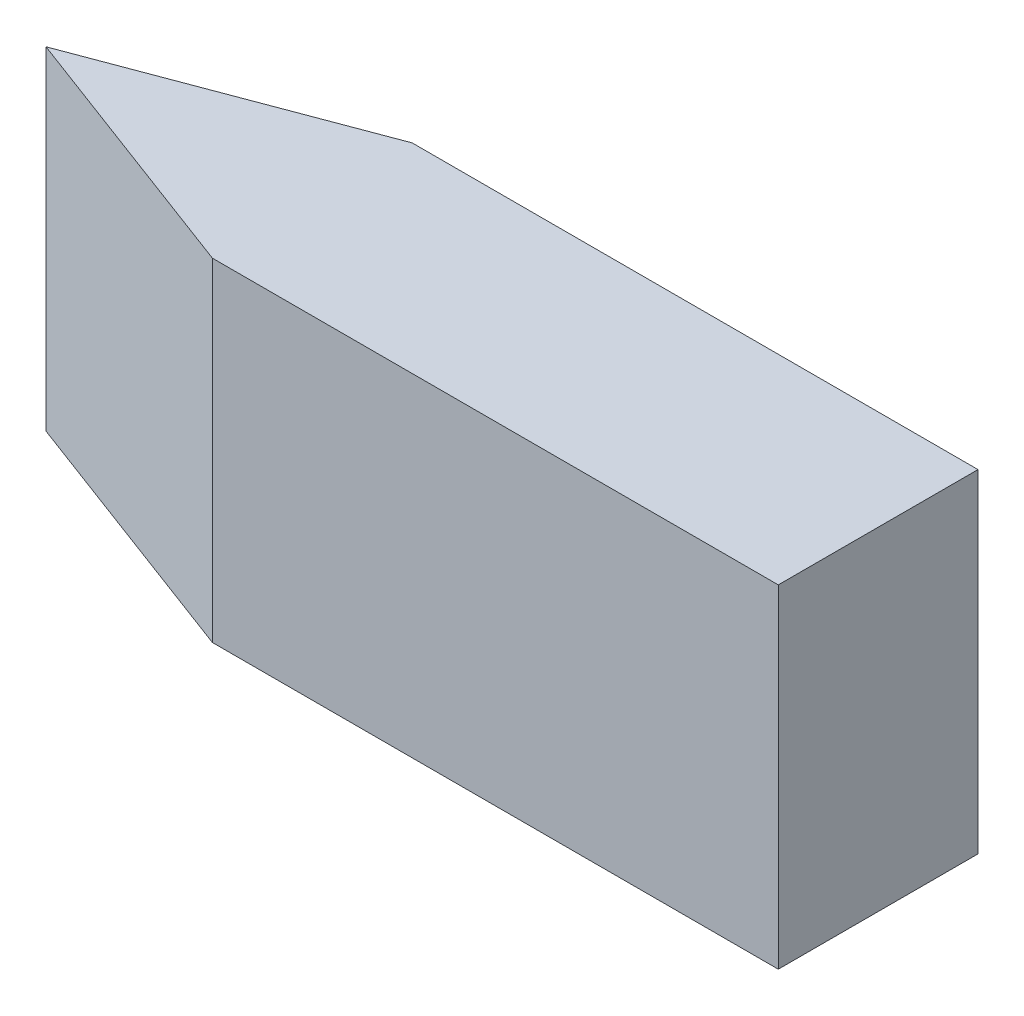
from build123d import *

# Parameters (mm, degrees)
EXTRUDE1_DEPTH = 10


with BuildPart() as part:
    # Sketch2 → Extrude1 (new body)
    with BuildSketch(Plane(origin=(0, 0, 0), x_dir=(1, 0, 0), z_dir=(0, 1, 0))):
        Polygon((-17, 6), (-25, 3), (-17, 0), (0, 0), (0, 6), align=None)
    extrude(amount=EXTRUDE1_DEPTH)


solid = part.part
